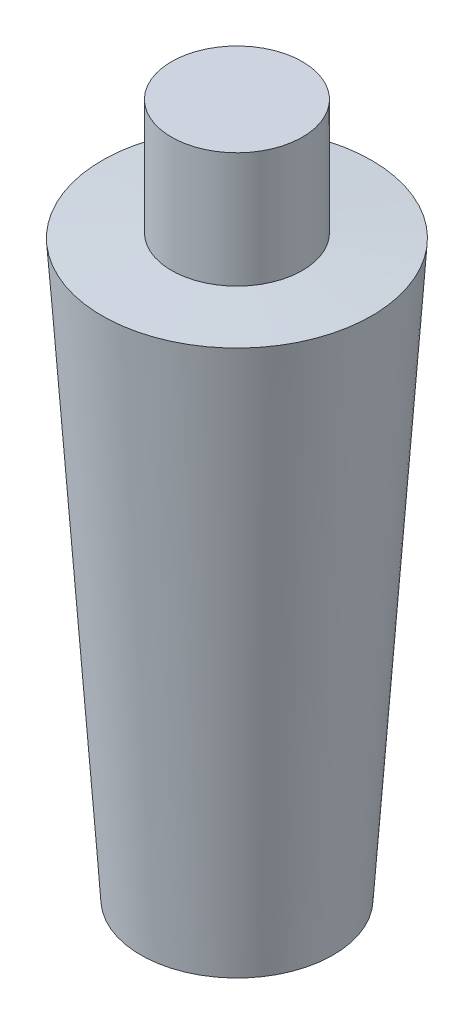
ISO-10303-21;
HEADER;
FILE_DESCRIPTION(('STEP AP214'),'2;1');
FILE_NAME('part.step','',(''),(''),'','','');
FILE_SCHEMA(('AUTOMOTIVE_DESIGN { 1 0 10303 214 1 1 1 1 }'));
ENDSEC;
DATA;
#1=APPLICATION_CONTEXT('core data for automotive mechanical design processes');
#2=APPLICATION_PROTOCOL_DEFINITION('international standard','automotive_design',2000,#1);
#3=PRODUCT_CONTEXT('',#1,'mechanical');
#4=PRODUCT('Part','Part','',(#3));
#5=PRODUCT_RELATED_PRODUCT_CATEGORY('part','',(#4));
#6=PRODUCT_DEFINITION_FORMATION('','',#4);
#7=PRODUCT_DEFINITION_CONTEXT('part definition',#1,'design');
#8=PRODUCT_DEFINITION('design','',#6,#7);
#9=PRODUCT_DEFINITION_SHAPE('','',#8);
#10=(LENGTH_UNIT() NAMED_UNIT(*) SI_UNIT(.MILLI.,.METRE.));
#11=(NAMED_UNIT(*) PLANE_ANGLE_UNIT() SI_UNIT($,.RADIAN.));
#12=(NAMED_UNIT(*) SI_UNIT($,.STERADIAN.) SOLID_ANGLE_UNIT());
#13=UNCERTAINTY_MEASURE_WITH_UNIT(LENGTH_MEASURE(1.E-05),#10,'distance_accuracy_value','');
#14=(GEOMETRIC_REPRESENTATION_CONTEXT(3) GLOBAL_UNCERTAINTY_ASSIGNED_CONTEXT((#13)) GLOBAL_UNIT_ASSIGNED_CONTEXT((#10,
#11,#12)) REPRESENTATION_CONTEXT('',''));
#15=CARTESIAN_POINT('',(0.,0.,0.));
#16=DIRECTION('',(0.,0.,1.));
#17=DIRECTION('',(1.,0.,0.));
#18=AXIS2_PLACEMENT_3D('',#15,#16,#17);
#19=CARTESIAN_POINT('',(0.,0.,0.));
#20=DIRECTION('',(0.,1.,0.));
#21=DIRECTION('',(0.,0.,1.));
#22=AXIS2_PLACEMENT_3D('',#19,#20,#21);
#23=PLANE('',#22);
#24=CARTESIAN_POINT('',(0.,0.,0.));
#25=DIRECTION('',(0.,-1.,0.));
#26=DIRECTION('',(0.,0.,-1.));
#27=AXIS2_PLACEMENT_3D('',#24,#25,#26);
#28=CIRCLE('',#27,250.);
#29=CARTESIAN_POINT('',(0.,0.,-250.));
#30=VERTEX_POINT('',#29);
#31=EDGE_CURVE('E10',#30,#30,#28,.T.);
#32=ORIENTED_EDGE('',*,*,#31,.T.);
#33=EDGE_LOOP('',(#32));
#34=FACE_BOUND('',#33,.T.);
#35=ADVANCED_FACE('F30',(#34),#23,.F.);
#36=CARTESIAN_POINT('',(0.,1487.90243257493,0.));
#37=DIRECTION('',(0.,1.,0.));
#38=DIRECTION('',(0.,0.,1.));
#39=AXIS2_PLACEMENT_3D('',#36,#37,#38);
#40=CONICAL_SURFACE('',#39,350.,0.0671077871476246);
#41=ORIENTED_EDGE('',*,*,#31,.F.);
#42=EDGE_LOOP('',(#41));
#43=FACE_BOUND('',#42,.T.);
#44=CARTESIAN_POINT('',(0.,1487.90243257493,0.));
#45=DIRECTION('',(0.,-1.,0.));
#46=DIRECTION('',(0.,0.,-1.));
#47=AXIS2_PLACEMENT_3D('',#44,#45,#46);
#48=CIRCLE('',#47,350.);
#49=CARTESIAN_POINT('',(0.,1487.90243257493,-350.));
#50=VERTEX_POINT('',#49);
#51=EDGE_CURVE('E36',#50,#50,#48,.T.);
#52=ORIENTED_EDGE('',*,*,#51,.T.);
#53=EDGE_LOOP('',(#52));
#54=FACE_BOUND('',#53,.T.);
#55=ADVANCED_FACE('F62',(#43,#54),#40,.T.);
#56=CARTESIAN_POINT('',(0.,1500.,0.));
#57=DIRECTION('',(0.,-1.,0.));
#58=DIRECTION('',(0.,0.,-1.));
#59=AXIS2_PLACEMENT_3D('',#56,#57,#58);
#60=CONICAL_SURFACE('',#59,170.,1.50368853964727);
#61=ORIENTED_EDGE('',*,*,#51,.F.);
#62=EDGE_LOOP('',(#61));
#63=FACE_BOUND('',#62,.T.);
#64=CARTESIAN_POINT('',(0.,1500.,0.));
#65=DIRECTION('',(0.,-1.,0.));
#66=DIRECTION('',(0.,0.,-1.));
#67=AXIS2_PLACEMENT_3D('',#64,#65,#66);
#68=CIRCLE('',#67,170.);
#69=CARTESIAN_POINT('',(0.,1500.,-170.));
#70=VERTEX_POINT('',#69);
#71=EDGE_CURVE('E40',#70,#70,#68,.T.);
#72=ORIENTED_EDGE('',*,*,#71,.T.);
#73=EDGE_LOOP('',(#72));
#74=FACE_BOUND('',#73,.T.);
#75=ADVANCED_FACE('F58',(#63,#74),#60,.T.);
#76=CARTESIAN_POINT('',(0.,0.,0.));
#77=DIRECTION('',(0.,-1.,0.));
#78=DIRECTION('',(0.,0.,-1.));
#79=AXIS2_PLACEMENT_3D('',#76,#77,#78);
#80=CYLINDRICAL_SURFACE('',#79,170.);
#81=ORIENTED_EDGE('',*,*,#71,.F.);
#82=EDGE_LOOP('',(#81));
#83=FACE_BOUND('',#82,.T.);
#84=CARTESIAN_POINT('',(0.,1800.,0.));
#85=DIRECTION('',(0.,-1.,0.));
#86=DIRECTION('',(0.,0.,-1.));
#87=AXIS2_PLACEMENT_3D('',#84,#85,#86);
#88=CIRCLE('',#87,170.);
#89=CARTESIAN_POINT('',(0.,1800.,-170.));
#90=VERTEX_POINT('',#89);
#91=EDGE_CURVE('E44',#90,#90,#88,.T.);
#92=ORIENTED_EDGE('',*,*,#91,.T.);
#93=EDGE_LOOP('',(#92));
#94=FACE_BOUND('',#93,.T.);
#95=ADVANCED_FACE('F50',(#83,#94),#80,.T.);
#96=CARTESIAN_POINT('',(-170.,1800.,0.));
#97=DIRECTION('',(0.,-1.,0.));
#98=DIRECTION('',(0.,0.,-1.));
#99=AXIS2_PLACEMENT_3D('',#96,#97,#98);
#100=PLANE('',#99);
#101=ORIENTED_EDGE('',*,*,#91,.F.);
#102=EDGE_LOOP('',(#101));
#103=FACE_BOUND('',#102,.T.);
#104=ADVANCED_FACE('F52',(#103),#100,.F.);
#105=CLOSED_SHELL('',(#35,#55,#75,#95,#104));
#106=MANIFOLD_SOLID_BREP('B2',#105);
#107=ADVANCED_BREP_SHAPE_REPRESENTATION('',(#18,#106),#14);
#108=SHAPE_DEFINITION_REPRESENTATION(#9,#107);
ENDSEC;
END-ISO-10303-21;
